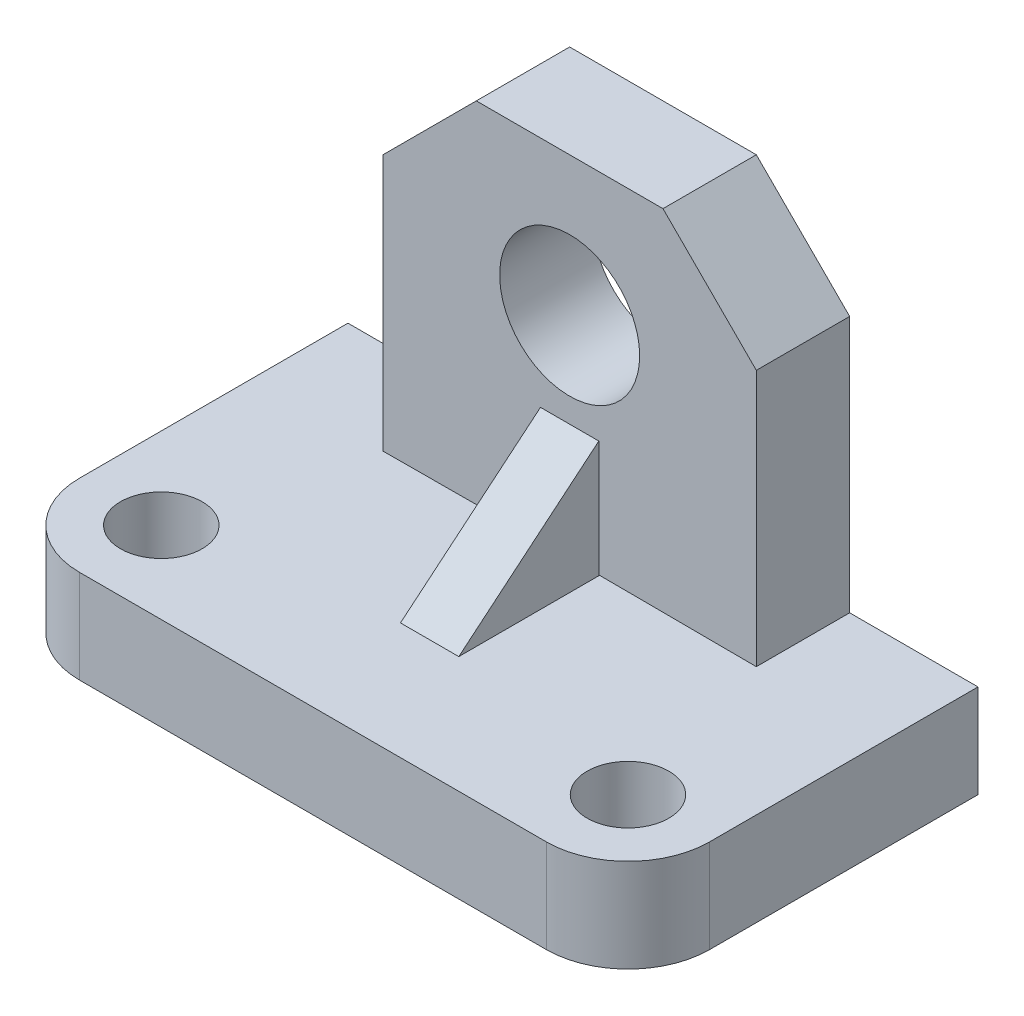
ISO-10303-21;
HEADER;
FILE_DESCRIPTION(('STEP AP214'),'2;1');
FILE_NAME('part.step','',(''),(''),'','','');
FILE_SCHEMA(('AUTOMOTIVE_DESIGN { 1 0 10303 214 1 1 1 1 }'));
ENDSEC;
DATA;
#1=APPLICATION_CONTEXT('core data for automotive mechanical design processes');
#2=APPLICATION_PROTOCOL_DEFINITION('international standard','automotive_design',2000,#1);
#3=PRODUCT_CONTEXT('',#1,'mechanical');
#4=PRODUCT('Part','Part','',(#3));
#5=PRODUCT_RELATED_PRODUCT_CATEGORY('part','',(#4));
#6=PRODUCT_DEFINITION_FORMATION('','',#4);
#7=PRODUCT_DEFINITION_CONTEXT('part definition',#1,'design');
#8=PRODUCT_DEFINITION('design','',#6,#7);
#9=PRODUCT_DEFINITION_SHAPE('','',#8);
#10=(LENGTH_UNIT() NAMED_UNIT(*) SI_UNIT(.MILLI.,.METRE.));
#11=(NAMED_UNIT(*) PLANE_ANGLE_UNIT() SI_UNIT($,.RADIAN.));
#12=(NAMED_UNIT(*) SI_UNIT($,.STERADIAN.) SOLID_ANGLE_UNIT());
#13=UNCERTAINTY_MEASURE_WITH_UNIT(LENGTH_MEASURE(1.E-05),#10,'distance_accuracy_value','');
#14=(GEOMETRIC_REPRESENTATION_CONTEXT(3) GLOBAL_UNCERTAINTY_ASSIGNED_CONTEXT((#13)) GLOBAL_UNIT_ASSIGNED_CONTEXT((#10,
#11,#12)) REPRESENTATION_CONTEXT('',''));
#15=CARTESIAN_POINT('',(0.,0.,0.));
#16=DIRECTION('',(0.,0.,1.));
#17=DIRECTION('',(1.,0.,0.));
#18=AXIS2_PLACEMENT_3D('',#15,#16,#17);
#19=CARTESIAN_POINT('',(2.5,18.,8.));
#20=DIRECTION('',(0.,0.,1.));
#21=DIRECTION('',(1.,0.,0.));
#22=AXIS2_PLACEMENT_3D('',#19,#20,#21);
#23=PLANE('',#22);
#24=DIRECTION('',(0.,1.,0.));
#25=VECTOR('',#24,1.);
#26=CARTESIAN_POINT('',(-2.5,18.,8.));
#27=LINE('',#26,#25);
#28=CARTESIAN_POINT('',(-2.5,8.,8.));
#29=VERTEX_POINT('',#28);
#30=CARTESIAN_POINT('',(-2.5,18.,8.));
#31=VERTEX_POINT('',#30);
#32=EDGE_CURVE('E88',#29,#31,#27,.T.);
#33=ORIENTED_EDGE('',*,*,#32,.T.);
#34=DIRECTION('',(-1.,0.,0.));
#35=VECTOR('',#34,1.);
#36=CARTESIAN_POINT('',(2.5,18.,8.));
#37=LINE('',#36,#35);
#38=CARTESIAN_POINT('',(2.5,18.,8.));
#39=VERTEX_POINT('',#38);
#40=EDGE_CURVE('E12',#39,#31,#37,.T.);
#41=ORIENTED_EDGE('',*,*,#40,.F.);
#42=DIRECTION('',(0.,1.,0.));
#43=VECTOR('',#42,1.);
#44=CARTESIAN_POINT('',(2.5,18.,8.));
#45=LINE('',#44,#43);
#46=CARTESIAN_POINT('',(2.5,8.,8.));
#47=VERTEX_POINT('',#46);
#48=EDGE_CURVE('E81',#47,#39,#45,.T.);
#49=ORIENTED_EDGE('',*,*,#48,.F.);
#50=DIRECTION('',(-1.,0.,0.));
#51=VECTOR('',#50,1.);
#52=CARTESIAN_POINT('',(2.5,8.,8.));
#53=LINE('',#52,#51);
#54=EDGE_CURVE('E89',#47,#29,#53,.T.);
#55=ORIENTED_EDGE('',*,*,#54,.T.);
#56=EDGE_LOOP('',(#33,#41,#49,#55));
#57=FACE_BOUND('',#56,.T.);
#58=ADVANCED_FACE('F41',(#57),#23,.F.);
#59=CARTESIAN_POINT('',(2.5,18.,8.));
#60=DIRECTION('',(0.,-0.768221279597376,-0.64018439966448));
#61=DIRECTION('',(0.,0.64018439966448,-0.768221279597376));
#62=AXIS2_PLACEMENT_3D('',#59,#60,#61);
#63=PLANE('',#62);
#64=DIRECTION('',(0.,-0.64018439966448,0.768221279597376));
#65=VECTOR('',#64,1.);
#66=CARTESIAN_POINT('',(-2.5,18.,8.));
#67=LINE('',#66,#65);
#68=CARTESIAN_POINT('',(-2.5,8.,20.));
#69=VERTEX_POINT('',#68);
#70=EDGE_CURVE('E69',#31,#69,#67,.T.);
#71=ORIENTED_EDGE('',*,*,#70,.T.);
#72=DIRECTION('',(-1.,0.,0.));
#73=VECTOR('',#72,1.);
#74=CARTESIAN_POINT('',(2.5,8.,20.));
#75=LINE('',#74,#73);
#76=CARTESIAN_POINT('',(2.5,8.,20.));
#77=VERTEX_POINT('',#76);
#78=EDGE_CURVE('E49',#77,#69,#75,.T.);
#79=ORIENTED_EDGE('',*,*,#78,.F.);
#80=DIRECTION('',(0.,-0.64018439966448,0.768221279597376));
#81=VECTOR('',#80,1.);
#82=CARTESIAN_POINT('',(2.5,18.,8.));
#83=LINE('',#82,#81);
#84=EDGE_CURVE('E77',#39,#77,#83,.T.);
#85=ORIENTED_EDGE('',*,*,#84,.F.);
#86=ORIENTED_EDGE('',*,*,#40,.T.);
#87=EDGE_LOOP('',(#71,#79,#85,#86));
#88=FACE_BOUND('',#87,.T.);
#89=ADVANCED_FACE('F78',(#88),#63,.F.);
#90=CARTESIAN_POINT('',(2.5,8.,8.));
#91=DIRECTION('',(0.,1.,0.));
#92=DIRECTION('',(0.,0.,1.));
#93=AXIS2_PLACEMENT_3D('',#90,#91,#92);
#94=PLANE('',#93);
#95=DIRECTION('',(0.,0.,-1.));
#96=VECTOR('',#95,1.);
#97=CARTESIAN_POINT('',(-2.5,8.,8.));
#98=LINE('',#97,#96);
#99=EDGE_CURVE('E74',#69,#29,#98,.T.);
#100=ORIENTED_EDGE('',*,*,#99,.T.);
#101=ORIENTED_EDGE('',*,*,#54,.F.);
#102=DIRECTION('',(0.,0.,-1.));
#103=VECTOR('',#102,1.);
#104=CARTESIAN_POINT('',(2.5,8.,8.));
#105=LINE('',#104,#103);
#106=EDGE_CURVE('E57',#77,#47,#105,.T.);
#107=ORIENTED_EDGE('',*,*,#106,.F.);
#108=ORIENTED_EDGE('',*,*,#78,.T.);
#109=EDGE_LOOP('',(#100,#101,#107,#108));
#110=FACE_BOUND('',#109,.T.);
#111=ADVANCED_FACE('F96',(#110),#94,.F.);
#112=CARTESIAN_POINT('',(2.5,8.,8.));
#113=DIRECTION('',(-1.,0.,0.));
#114=DIRECTION('',(0.,0.,1.));
#115=AXIS2_PLACEMENT_3D('',#112,#113,#114);
#116=PLANE('',#115);
#117=ORIENTED_EDGE('',*,*,#48,.T.);
#118=ORIENTED_EDGE('',*,*,#84,.T.);
#119=ORIENTED_EDGE('',*,*,#106,.T.);
#120=EDGE_LOOP('',(#117,#118,#119));
#121=FACE_BOUND('',#120,.T.);
#122=ADVANCED_FACE('F84',(#121),#116,.F.);
#123=CARTESIAN_POINT('',(-2.5,8.,8.));
#124=DIRECTION('',(-1.,0.,0.));
#125=DIRECTION('',(0.,0.,1.));
#126=AXIS2_PLACEMENT_3D('',#123,#124,#125);
#127=PLANE('',#126);
#128=ORIENTED_EDGE('',*,*,#32,.F.);
#129=ORIENTED_EDGE('',*,*,#99,.F.);
#130=ORIENTED_EDGE('',*,*,#70,.F.);
#131=EDGE_LOOP('',(#128,#129,#130));
#132=FACE_BOUND('',#131,.T.);
#133=ADVANCED_FACE('F97',(#132),#127,.T.);
#134=CLOSED_SHELL('',(#58,#89,#111,#122,#133));
#135=MANIFOLD_SOLID_BREP('B2',#134);
#136=CARTESIAN_POINT('',(16.,8.,8.));
#137=DIRECTION('',(0.,0.,1.));
#138=DIRECTION('',(1.,0.,0.));
#139=AXIS2_PLACEMENT_3D('',#136,#137,#138);
#140=PLANE('',#139);
#141=DIRECTION('',(0.999988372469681,-0.00482233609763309,0.));
#142=VECTOR('',#141,1.);
#143=CARTESIAN_POINT('',(0.,8.07715827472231,8.));
#144=LINE('',#143,#142);
#145=CARTESIAN_POINT('',(0.,8.07715827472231,8.));
#146=VERTEX_POINT('',#145);
#147=CARTESIAN_POINT('',(16.,8.,8.));
#148=VERTEX_POINT('',#147);
#149=EDGE_CURVE('E251',#146,#148,#144,.T.);
#150=ORIENTED_EDGE('',*,*,#149,.T.);
#151=DIRECTION('',(0.,1.,0.));
#152=VECTOR('',#151,1.);
#153=CARTESIAN_POINT('',(16.,8.,8.));
#154=LINE('',#153,#152);
#155=CARTESIAN_POINT('',(16.,30.,8.));
#156=VERTEX_POINT('',#155);
#157=EDGE_CURVE('E204',#148,#156,#154,.T.);
#158=ORIENTED_EDGE('',*,*,#157,.T.);
#159=DIRECTION('',(-0.707106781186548,0.707106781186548,0.));
#160=VECTOR('',#159,1.);
#161=CARTESIAN_POINT('',(16.,30.,8.));
#162=LINE('',#161,#160);
#163=CARTESIAN_POINT('',(8.,38.,8.));
#164=VERTEX_POINT('',#163);
#165=EDGE_CURVE('E263',#156,#164,#162,.T.);
#166=ORIENTED_EDGE('',*,*,#165,.T.);
#167=DIRECTION('',(-1.,0.,0.));
#168=VECTOR('',#167,1.);
#169=CARTESIAN_POINT('',(-8.,38.,8.));
#170=LINE('',#169,#168);
#171=CARTESIAN_POINT('',(-8.,38.,8.));
#172=VERTEX_POINT('',#171);
#173=EDGE_CURVE('E220',#164,#172,#170,.T.);
#174=ORIENTED_EDGE('',*,*,#173,.T.);
#175=DIRECTION('',(-0.707106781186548,-0.707106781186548,0.));
#176=VECTOR('',#175,1.);
#177=CARTESIAN_POINT('',(-16.,30.,8.));
#178=LINE('',#177,#176);
#179=CARTESIAN_POINT('',(-16.,30.,8.));
#180=VERTEX_POINT('',#179);
#181=EDGE_CURVE('E214',#172,#180,#178,.T.);
#182=ORIENTED_EDGE('',*,*,#181,.T.);
#183=DIRECTION('',(0.,-1.,0.));
#184=VECTOR('',#183,1.);
#185=CARTESIAN_POINT('',(-16.,8.,8.));
#186=LINE('',#185,#184);
#187=CARTESIAN_POINT('',(-16.,8.,8.));
#188=VERTEX_POINT('',#187);
#189=EDGE_CURVE('E218',#180,#188,#186,.T.);
#190=ORIENTED_EDGE('',*,*,#189,.T.);
#191=DIRECTION('',(0.999988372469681,0.00482233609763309,0.));
#192=VECTOR('',#191,1.);
#193=CARTESIAN_POINT('',(0.,8.07715827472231,8.));
#194=LINE('',#193,#192);
#195=EDGE_CURVE('E164',#188,#146,#194,.T.);
#196=ORIENTED_EDGE('',*,*,#195,.T.);
#197=EDGE_LOOP('',(#150,#158,#166,#174,#182,#190,#196));
#198=FACE_BOUND('',#197,.T.);
#199=CARTESIAN_POINT('',(0.,26.0771582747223,8.));
#200=DIRECTION('',(0.,0.,1.));
#201=DIRECTION('',(1.,0.,0.));
#202=AXIS2_PLACEMENT_3D('',#199,#200,#201);
#203=CIRCLE('',#202,6.);
#204=CARTESIAN_POINT('',(6.,26.0771582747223,8.));
#205=VERTEX_POINT('',#204);
#206=EDGE_CURVE('E242',#205,#205,#203,.T.);
#207=ORIENTED_EDGE('',*,*,#206,.F.);
#208=EDGE_LOOP('',(#207));
#209=FACE_BOUND('',#208,.T.);
#210=ADVANCED_FACE('F147',(#198,#209),#140,.T.);
#211=CARTESIAN_POINT('',(16.,8.,0.));
#212=DIRECTION('',(0.,0.,1.));
#213=DIRECTION('',(1.,0.,0.));
#214=AXIS2_PLACEMENT_3D('',#211,#212,#213);
#215=PLANE('',#214);
#216=DIRECTION('',(0.999988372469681,-0.00482233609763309,0.));
#217=VECTOR('',#216,1.);
#218=CARTESIAN_POINT('',(0.,8.07715827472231,0.));
#219=LINE('',#218,#217);
#220=CARTESIAN_POINT('',(0.,8.07715827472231,0.));
#221=VERTEX_POINT('',#220);
#222=CARTESIAN_POINT('',(16.,8.,0.));
#223=VERTEX_POINT('',#222);
#224=EDGE_CURVE('E238',#221,#223,#219,.T.);
#225=ORIENTED_EDGE('',*,*,#224,.F.);
#226=DIRECTION('',(0.999988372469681,0.00482233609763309,0.));
#227=VECTOR('',#226,1.);
#228=CARTESIAN_POINT('',(0.,8.07715827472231,0.));
#229=LINE('',#228,#227);
#230=CARTESIAN_POINT('',(-16.,8.,0.));
#231=VERTEX_POINT('',#230);
#232=EDGE_CURVE('E196',#231,#221,#229,.T.);
#233=ORIENTED_EDGE('',*,*,#232,.F.);
#234=DIRECTION('',(0.,-1.,0.));
#235=VECTOR('',#234,1.);
#236=CARTESIAN_POINT('',(-16.,8.,0.));
#237=LINE('',#236,#235);
#238=CARTESIAN_POINT('',(-16.,30.,0.));
#239=VERTEX_POINT('',#238);
#240=EDGE_CURVE('E190',#239,#231,#237,.T.);
#241=ORIENTED_EDGE('',*,*,#240,.F.);
#242=DIRECTION('',(-0.707106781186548,-0.707106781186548,0.));
#243=VECTOR('',#242,1.);
#244=CARTESIAN_POINT('',(-16.,30.,0.));
#245=LINE('',#244,#243);
#246=CARTESIAN_POINT('',(-8.,38.,0.));
#247=VERTEX_POINT('',#246);
#248=EDGE_CURVE('E228',#247,#239,#245,.T.);
#249=ORIENTED_EDGE('',*,*,#248,.F.);
#250=DIRECTION('',(-1.,0.,0.));
#251=VECTOR('',#250,1.);
#252=CARTESIAN_POINT('',(-8.,38.,0.));
#253=LINE('',#252,#251);
#254=CARTESIAN_POINT('',(8.,38.,0.));
#255=VERTEX_POINT('',#254);
#256=EDGE_CURVE('E246',#255,#247,#253,.T.);
#257=ORIENTED_EDGE('',*,*,#256,.F.);
#258=DIRECTION('',(-0.707106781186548,0.707106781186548,0.));
#259=VECTOR('',#258,1.);
#260=CARTESIAN_POINT('',(16.,30.,0.));
#261=LINE('',#260,#259);
#262=CARTESIAN_POINT('',(16.,30.,0.));
#263=VERTEX_POINT('',#262);
#264=EDGE_CURVE('E244',#263,#255,#261,.T.);
#265=ORIENTED_EDGE('',*,*,#264,.F.);
#266=DIRECTION('',(0.,1.,0.));
#267=VECTOR('',#266,1.);
#268=CARTESIAN_POINT('',(16.,8.,0.));
#269=LINE('',#268,#267);
#270=EDGE_CURVE('E241',#223,#263,#269,.T.);
#271=ORIENTED_EDGE('',*,*,#270,.F.);
#272=EDGE_LOOP('',(#225,#233,#241,#249,#257,#265,#271));
#273=FACE_BOUND('',#272,.T.);
#274=CARTESIAN_POINT('',(0.,26.0771582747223,0.));
#275=DIRECTION('',(0.,0.,1.));
#276=DIRECTION('',(1.,0.,0.));
#277=AXIS2_PLACEMENT_3D('',#274,#275,#276);
#278=CIRCLE('',#277,6.);
#279=CARTESIAN_POINT('',(6.,26.0771582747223,0.));
#280=VERTEX_POINT('',#279);
#281=EDGE_CURVE('E275',#280,#280,#278,.T.);
#282=ORIENTED_EDGE('',*,*,#281,.T.);
#283=EDGE_LOOP('',(#282));
#284=FACE_BOUND('',#283,.T.);
#285=ADVANCED_FACE('F267',(#273,#284),#215,.F.);
#286=CARTESIAN_POINT('',(0.,8.07715827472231,8.));
#287=DIRECTION('',(0.00482233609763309,0.999988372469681,0.));
#288=DIRECTION('',(-0.999988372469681,0.00482233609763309,0.));
#289=AXIS2_PLACEMENT_3D('',#286,#287,#288);
#290=PLANE('',#289);
#291=ORIENTED_EDGE('',*,*,#224,.T.);
#292=DIRECTION('',(0.,0.,-1.));
#293=VECTOR('',#292,1.);
#294=CARTESIAN_POINT('',(16.,8.,8.));
#295=LINE('',#294,#293);
#296=EDGE_CURVE('E39',#148,#223,#295,.T.);
#297=ORIENTED_EDGE('',*,*,#296,.F.);
#298=ORIENTED_EDGE('',*,*,#149,.F.);
#299=DIRECTION('',(0.,0.,-1.));
#300=VECTOR('',#299,1.);
#301=CARTESIAN_POINT('',(0.,8.07715827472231,8.));
#302=LINE('',#301,#300);
#303=EDGE_CURVE('E234',#146,#221,#302,.T.);
#304=ORIENTED_EDGE('',*,*,#303,.T.);
#305=EDGE_LOOP('',(#291,#297,#298,#304));
#306=FACE_BOUND('',#305,.T.);
#307=ADVANCED_FACE('F149',(#306),#290,.F.);
#308=CARTESIAN_POINT('',(16.,8.,8.));
#309=DIRECTION('',(-1.,0.,0.));
#310=DIRECTION('',(0.,0.,1.));
#311=AXIS2_PLACEMENT_3D('',#308,#309,#310);
#312=PLANE('',#311);
#313=ORIENTED_EDGE('',*,*,#270,.T.);
#314=DIRECTION('',(0.,0.,-1.));
#315=VECTOR('',#314,1.);
#316=CARTESIAN_POINT('',(16.,30.,8.));
#317=LINE('',#316,#315);
#318=EDGE_CURVE('E156',#156,#263,#317,.T.);
#319=ORIENTED_EDGE('',*,*,#318,.F.);
#320=ORIENTED_EDGE('',*,*,#157,.F.);
#321=ORIENTED_EDGE('',*,*,#296,.T.);
#322=EDGE_LOOP('',(#313,#319,#320,#321));
#323=FACE_BOUND('',#322,.T.);
#324=ADVANCED_FACE('F301',(#323),#312,.F.);
#325=CARTESIAN_POINT('',(16.,30.,8.));
#326=DIRECTION('',(-0.707106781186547,-0.707106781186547,0.));
#327=DIRECTION('',(0.707106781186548,-0.707106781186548,0.));
#328=AXIS2_PLACEMENT_3D('',#325,#326,#327);
#329=PLANE('',#328);
#330=ORIENTED_EDGE('',*,*,#264,.T.);
#331=DIRECTION('',(0.,0.,-1.));
#332=VECTOR('',#331,1.);
#333=CARTESIAN_POINT('',(8.,38.,8.));
#334=LINE('',#333,#332);
#335=EDGE_CURVE('E255',#164,#255,#334,.T.);
#336=ORIENTED_EDGE('',*,*,#335,.F.);
#337=ORIENTED_EDGE('',*,*,#165,.F.);
#338=ORIENTED_EDGE('',*,*,#318,.T.);
#339=EDGE_LOOP('',(#330,#336,#337,#338));
#340=FACE_BOUND('',#339,.T.);
#341=ADVANCED_FACE('F261',(#340),#329,.F.);
#342=CARTESIAN_POINT('',(-8.,38.,8.));
#343=DIRECTION('',(0.,-1.,0.));
#344=DIRECTION('',(0.,0.,-1.));
#345=AXIS2_PLACEMENT_3D('',#342,#343,#344);
#346=PLANE('',#345);
#347=ORIENTED_EDGE('',*,*,#256,.T.);
#348=DIRECTION('',(0.,0.,-1.));
#349=VECTOR('',#348,1.);
#350=CARTESIAN_POINT('',(-8.,38.,8.));
#351=LINE('',#350,#349);
#352=EDGE_CURVE('E229',#172,#247,#351,.T.);
#353=ORIENTED_EDGE('',*,*,#352,.F.);
#354=ORIENTED_EDGE('',*,*,#173,.F.);
#355=ORIENTED_EDGE('',*,*,#335,.T.);
#356=EDGE_LOOP('',(#347,#353,#354,#355));
#357=FACE_BOUND('',#356,.T.);
#358=ADVANCED_FACE('F270',(#357),#346,.F.);
#359=CARTESIAN_POINT('',(-16.,30.,8.));
#360=DIRECTION('',(0.707106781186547,-0.707106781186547,0.));
#361=DIRECTION('',(0.707106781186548,0.707106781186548,0.));
#362=AXIS2_PLACEMENT_3D('',#359,#360,#361);
#363=PLANE('',#362);
#364=ORIENTED_EDGE('',*,*,#248,.T.);
#365=DIRECTION('',(0.,0.,-1.));
#366=VECTOR('',#365,1.);
#367=CARTESIAN_POINT('',(-16.,30.,8.));
#368=LINE('',#367,#366);
#369=EDGE_CURVE('E225',#180,#239,#368,.T.);
#370=ORIENTED_EDGE('',*,*,#369,.F.);
#371=ORIENTED_EDGE('',*,*,#181,.F.);
#372=ORIENTED_EDGE('',*,*,#352,.T.);
#373=EDGE_LOOP('',(#364,#370,#371,#372));
#374=FACE_BOUND('',#373,.T.);
#375=ADVANCED_FACE('F226',(#374),#363,.F.);
#376=CARTESIAN_POINT('',(-16.,8.,8.));
#377=DIRECTION('',(1.,0.,0.));
#378=DIRECTION('',(0.,0.,-1.));
#379=AXIS2_PLACEMENT_3D('',#376,#377,#378);
#380=PLANE('',#379);
#381=ORIENTED_EDGE('',*,*,#240,.T.);
#382=DIRECTION('',(0.,0.,-1.));
#383=VECTOR('',#382,1.);
#384=CARTESIAN_POINT('',(-16.,8.,8.));
#385=LINE('',#384,#383);
#386=EDGE_CURVE('E230',#188,#231,#385,.T.);
#387=ORIENTED_EDGE('',*,*,#386,.F.);
#388=ORIENTED_EDGE('',*,*,#189,.F.);
#389=ORIENTED_EDGE('',*,*,#369,.T.);
#390=EDGE_LOOP('',(#381,#387,#388,#389));
#391=FACE_BOUND('',#390,.T.);
#392=ADVANCED_FACE('F232',(#391),#380,.F.);
#393=CARTESIAN_POINT('',(0.,8.07715827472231,8.));
#394=DIRECTION('',(-0.00482233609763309,0.999988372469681,0.));
#395=DIRECTION('',(-0.999988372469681,-0.00482233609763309,0.));
#396=AXIS2_PLACEMENT_3D('',#393,#394,#395);
#397=PLANE('',#396);
#398=ORIENTED_EDGE('',*,*,#232,.T.);
#399=ORIENTED_EDGE('',*,*,#303,.F.);
#400=ORIENTED_EDGE('',*,*,#195,.F.);
#401=ORIENTED_EDGE('',*,*,#386,.T.);
#402=EDGE_LOOP('',(#398,#399,#400,#401));
#403=FACE_BOUND('',#402,.T.);
#404=ADVANCED_FACE('F291',(#403),#397,.F.);
#405=CARTESIAN_POINT('',(0.,26.0771582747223,8.));
#406=DIRECTION('',(0.,0.,-1.));
#407=DIRECTION('',(-1.,0.,0.));
#408=AXIS2_PLACEMENT_3D('',#405,#406,#407);
#409=CYLINDRICAL_SURFACE('',#408,6.);
#410=ORIENTED_EDGE('',*,*,#206,.T.);
#411=EDGE_LOOP('',(#410));
#412=FACE_BOUND('',#411,.T.);
#413=ORIENTED_EDGE('',*,*,#281,.F.);
#414=EDGE_LOOP('',(#413));
#415=FACE_BOUND('',#414,.T.);
#416=ADVANCED_FACE('F281',(#412,#415),#409,.F.);
#417=CLOSED_SHELL('',(#210,#285,#307,#324,#341,#358,#375,#392,#404,#416));
#418=MANIFOLD_SOLID_BREP('B6',#417);
#419=CARTESIAN_POINT('',(-20.,8.,23.));
#420=DIRECTION('',(0.,-1.,0.));
#421=DIRECTION('',(0.,0.,-1.));
#422=AXIS2_PLACEMENT_3D('',#419,#420,#421);
#423=PLANE('',#422);
#424=CARTESIAN_POINT('',(-20.,8.,23.));
#425=DIRECTION('',(0.,1.,0.));
#426=DIRECTION('',(0.,0.,1.));
#427=AXIS2_PLACEMENT_3D('',#424,#425,#426);
#428=CIRCLE('',#427,3.5);
#429=CARTESIAN_POINT('',(-20.,8.,26.5));
#430=VERTEX_POINT('',#429);
#431=EDGE_CURVE('E458',#430,#430,#428,.T.);
#432=ORIENTED_EDGE('',*,*,#431,.F.);
#433=EDGE_LOOP('',(#432));
#434=FACE_BOUND('',#433,.T.);
#435=DIRECTION('',(0.,0.,1.));
#436=VECTOR('',#435,1.);
#437=CARTESIAN_POINT('',(-27.,8.,0.));
#438=LINE('',#437,#436);
#439=CARTESIAN_POINT('',(-27.,8.,0.));
#440=VERTEX_POINT('',#439);
#441=CARTESIAN_POINT('',(-27.,8.,23.));
#442=VERTEX_POINT('',#441);
#443=EDGE_CURVE('E465',#440,#442,#438,.T.);
#444=ORIENTED_EDGE('',*,*,#443,.T.);
#445=CARTESIAN_POINT('',(-20.,8.,23.));
#446=DIRECTION('',(0.,1.,0.));
#447=DIRECTION('',(0.,0.,-1.));
#448=AXIS2_PLACEMENT_3D('',#445,#446,#447);
#449=CIRCLE('',#448,7.);
#450=CARTESIAN_POINT('',(-19.9999999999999,8.,30.));
#451=VERTEX_POINT('',#450);
#452=EDGE_CURVE('E423',#442,#451,#449,.T.);
#453=ORIENTED_EDGE('',*,*,#452,.T.);
#454=DIRECTION('',(1.,0.,0.));
#455=VECTOR('',#454,1.);
#456=CARTESIAN_POINT('',(-19.9999999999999,8.,30.));
#457=LINE('',#456,#455);
#458=CARTESIAN_POINT('',(19.9999999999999,8.,30.));
#459=VERTEX_POINT('',#458);
#460=EDGE_CURVE('E436',#451,#459,#457,.T.);
#461=ORIENTED_EDGE('',*,*,#460,.T.);
#462=CARTESIAN_POINT('',(20.,8.,23.));
#463=DIRECTION('',(0.,1.,0.));
#464=DIRECTION('',(0.,0.,1.));
#465=AXIS2_PLACEMENT_3D('',#462,#463,#464);
#466=CIRCLE('',#465,7.);
#467=CARTESIAN_POINT('',(27.,8.,23.));
#468=VERTEX_POINT('',#467);
#469=EDGE_CURVE('E430',#459,#468,#466,.T.);
#470=ORIENTED_EDGE('',*,*,#469,.T.);
#471=DIRECTION('',(0.,0.,-1.));
#472=VECTOR('',#471,1.);
#473=CARTESIAN_POINT('',(27.,8.,0.));
#474=LINE('',#473,#472);
#475=CARTESIAN_POINT('',(27.,8.,0.));
#476=VERTEX_POINT('',#475);
#477=EDGE_CURVE('E434',#468,#476,#474,.T.);
#478=ORIENTED_EDGE('',*,*,#477,.T.);
#479=DIRECTION('',(-1.,0.,0.));
#480=VECTOR('',#479,1.);
#481=CARTESIAN_POINT('',(27.,8.,0.));
#482=LINE('',#481,#480);
#483=EDGE_CURVE('E386',#476,#440,#482,.T.);
#484=ORIENTED_EDGE('',*,*,#483,.T.);
#485=EDGE_LOOP('',(#444,#453,#461,#470,#478,#484));
#486=FACE_BOUND('',#485,.T.);
#487=CARTESIAN_POINT('',(20.,8.,23.));
#488=DIRECTION('',(0.,1.,0.));
#489=DIRECTION('',(0.,0.,-1.));
#490=AXIS2_PLACEMENT_3D('',#487,#488,#489);
#491=CIRCLE('',#490,3.5);
#492=CARTESIAN_POINT('',(20.,8.,19.5));
#493=VERTEX_POINT('',#492);
#494=EDGE_CURVE('E508',#493,#493,#491,.T.);
#495=ORIENTED_EDGE('',*,*,#494,.F.);
#496=EDGE_LOOP('',(#495));
#497=FACE_BOUND('',#496,.T.);
#498=ADVANCED_FACE('F369',(#434,#486,#497),#423,.F.);
#499=CARTESIAN_POINT('',(-20.,0.,23.));
#500=DIRECTION('',(0.,-1.,0.));
#501=DIRECTION('',(0.,0.,-1.));
#502=AXIS2_PLACEMENT_3D('',#499,#500,#501);
#503=PLANE('',#502);
#504=CARTESIAN_POINT('',(-20.,0.,23.));
#505=DIRECTION('',(0.,1.,0.));
#506=DIRECTION('',(0.,0.,1.));
#507=AXIS2_PLACEMENT_3D('',#504,#505,#506);
#508=CIRCLE('',#507,3.5);
#509=CARTESIAN_POINT('',(-20.,0.,26.5));
#510=VERTEX_POINT('',#509);
#511=EDGE_CURVE('E513',#510,#510,#508,.T.);
#512=ORIENTED_EDGE('',*,*,#511,.T.);
#513=EDGE_LOOP('',(#512));
#514=FACE_BOUND('',#513,.T.);
#515=DIRECTION('',(0.,0.,1.));
#516=VECTOR('',#515,1.);
#517=CARTESIAN_POINT('',(-27.,0.,0.));
#518=LINE('',#517,#516);
#519=CARTESIAN_POINT('',(-27.,0.,0.));
#520=VERTEX_POINT('',#519);
#521=CARTESIAN_POINT('',(-27.,0.,23.));
#522=VERTEX_POINT('',#521);
#523=EDGE_CURVE('E454',#520,#522,#518,.T.);
#524=ORIENTED_EDGE('',*,*,#523,.F.);
#525=DIRECTION('',(-1.,0.,0.));
#526=VECTOR('',#525,1.);
#527=CARTESIAN_POINT('',(27.,0.,0.));
#528=LINE('',#527,#526);
#529=CARTESIAN_POINT('',(27.,0.,0.));
#530=VERTEX_POINT('',#529);
#531=EDGE_CURVE('E415',#530,#520,#528,.T.);
#532=ORIENTED_EDGE('',*,*,#531,.F.);
#533=DIRECTION('',(0.,0.,-1.));
#534=VECTOR('',#533,1.);
#535=CARTESIAN_POINT('',(27.,0.,0.));
#536=LINE('',#535,#534);
#537=CARTESIAN_POINT('',(27.,0.,23.));
#538=VERTEX_POINT('',#537);
#539=EDGE_CURVE('E409',#538,#530,#536,.T.);
#540=ORIENTED_EDGE('',*,*,#539,.F.);
#541=CARTESIAN_POINT('',(20.,0.,23.));
#542=DIRECTION('',(0.,1.,0.));
#543=DIRECTION('',(0.,0.,1.));
#544=AXIS2_PLACEMENT_3D('',#541,#542,#543);
#545=CIRCLE('',#544,7.);
#546=CARTESIAN_POINT('',(19.9999999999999,0.,30.));
#547=VERTEX_POINT('',#546);
#548=EDGE_CURVE('E444',#547,#538,#545,.T.);
#549=ORIENTED_EDGE('',*,*,#548,.F.);
#550=DIRECTION('',(1.,0.,0.));
#551=VECTOR('',#550,1.);
#552=CARTESIAN_POINT('',(-19.9999999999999,0.,30.));
#553=LINE('',#552,#551);
#554=CARTESIAN_POINT('',(-19.9999999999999,0.,30.));
#555=VERTEX_POINT('',#554);
#556=EDGE_CURVE('E460',#555,#547,#553,.T.);
#557=ORIENTED_EDGE('',*,*,#556,.F.);
#558=CARTESIAN_POINT('',(-20.,0.,23.));
#559=DIRECTION('',(0.,1.,0.));
#560=DIRECTION('',(0.,0.,-1.));
#561=AXIS2_PLACEMENT_3D('',#558,#559,#560);
#562=CIRCLE('',#561,7.);
#563=EDGE_CURVE('E457',#522,#555,#562,.T.);
#564=ORIENTED_EDGE('',*,*,#563,.F.);
#565=EDGE_LOOP('',(#524,#532,#540,#549,#557,#564));
#566=FACE_BOUND('',#565,.T.);
#567=CARTESIAN_POINT('',(20.,0.,23.));
#568=DIRECTION('',(0.,1.,0.));
#569=DIRECTION('',(0.,0.,-1.));
#570=AXIS2_PLACEMENT_3D('',#567,#568,#569);
#571=CIRCLE('',#570,3.5);
#572=CARTESIAN_POINT('',(20.,0.,19.5));
#573=VERTEX_POINT('',#572);
#574=EDGE_CURVE('E511',#573,#573,#571,.T.);
#575=ORIENTED_EDGE('',*,*,#574,.T.);
#576=EDGE_LOOP('',(#575));
#577=FACE_BOUND('',#576,.T.);
#578=ADVANCED_FACE('F474',(#514,#566,#577),#503,.T.);
#579=CARTESIAN_POINT('',(-27.,8.,0.));
#580=DIRECTION('',(1.,0.,0.));
#581=DIRECTION('',(0.,0.,-1.));
#582=AXIS2_PLACEMENT_3D('',#579,#580,#581);
#583=PLANE('',#582);
#584=ORIENTED_EDGE('',*,*,#523,.T.);
#585=DIRECTION('',(0.,-1.,0.));
#586=VECTOR('',#585,1.);
#587=CARTESIAN_POINT('',(-27.,8.,23.));
#588=LINE('',#587,#586);
#589=EDGE_CURVE('E145',#442,#522,#588,.T.);
#590=ORIENTED_EDGE('',*,*,#589,.F.);
#591=ORIENTED_EDGE('',*,*,#443,.F.);
#592=DIRECTION('',(0.,-1.,0.));
#593=VECTOR('',#592,1.);
#594=CARTESIAN_POINT('',(-27.,8.,0.));
#595=LINE('',#594,#593);
#596=EDGE_CURVE('E450',#440,#520,#595,.T.);
#597=ORIENTED_EDGE('',*,*,#596,.T.);
#598=EDGE_LOOP('',(#584,#590,#591,#597));
#599=FACE_BOUND('',#598,.T.);
#600=ADVANCED_FACE('F371',(#599),#583,.F.);
#601=CARTESIAN_POINT('',(-20.,8.,23.));
#602=DIRECTION('',(0.,-1.,0.));
#603=DIRECTION('',(0.,0.,-1.));
#604=AXIS2_PLACEMENT_3D('',#601,#602,#603);
#605=CYLINDRICAL_SURFACE('',#604,7.);
#606=ORIENTED_EDGE('',*,*,#563,.T.);
#607=DIRECTION('',(0.,-1.,0.));
#608=VECTOR('',#607,1.);
#609=CARTESIAN_POINT('',(-19.9999999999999,8.,30.));
#610=LINE('',#609,#608);
#611=EDGE_CURVE('E378',#451,#555,#610,.T.);
#612=ORIENTED_EDGE('',*,*,#611,.F.);
#613=ORIENTED_EDGE('',*,*,#452,.F.);
#614=ORIENTED_EDGE('',*,*,#589,.T.);
#615=EDGE_LOOP('',(#606,#612,#613,#614));
#616=FACE_BOUND('',#615,.T.);
#617=ADVANCED_FACE('F554',(#616),#605,.T.);
#618=CARTESIAN_POINT('',(-19.9999999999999,8.,30.));
#619=DIRECTION('',(0.,0.,-1.));
#620=DIRECTION('',(-1.,0.,0.));
#621=AXIS2_PLACEMENT_3D('',#618,#619,#620);
#622=PLANE('',#621);
#623=ORIENTED_EDGE('',*,*,#556,.T.);
#624=DIRECTION('',(0.,-1.,0.));
#625=VECTOR('',#624,1.);
#626=CARTESIAN_POINT('',(19.9999999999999,8.,30.));
#627=LINE('',#626,#625);
#628=EDGE_CURVE('E445',#459,#547,#627,.T.);
#629=ORIENTED_EDGE('',*,*,#628,.F.);
#630=ORIENTED_EDGE('',*,*,#460,.F.);
#631=ORIENTED_EDGE('',*,*,#611,.T.);
#632=EDGE_LOOP('',(#623,#629,#630,#631));
#633=FACE_BOUND('',#632,.T.);
#634=ADVANCED_FACE('F471',(#633),#622,.F.);
#635=CARTESIAN_POINT('',(20.,8.,23.));
#636=DIRECTION('',(0.,-1.,0.));
#637=DIRECTION('',(0.,0.,-1.));
#638=AXIS2_PLACEMENT_3D('',#635,#636,#637);
#639=CYLINDRICAL_SURFACE('',#638,7.);
#640=ORIENTED_EDGE('',*,*,#548,.T.);
#641=DIRECTION('',(0.,-1.,0.));
#642=VECTOR('',#641,1.);
#643=CARTESIAN_POINT('',(27.,8.,23.));
#644=LINE('',#643,#642);
#645=EDGE_CURVE('E441',#468,#538,#644,.T.);
#646=ORIENTED_EDGE('',*,*,#645,.F.);
#647=ORIENTED_EDGE('',*,*,#469,.F.);
#648=ORIENTED_EDGE('',*,*,#628,.T.);
#649=EDGE_LOOP('',(#640,#646,#647,#648));
#650=FACE_BOUND('',#649,.T.);
#651=ADVANCED_FACE('F442',(#650),#639,.T.);
#652=CARTESIAN_POINT('',(27.,8.,0.));
#653=DIRECTION('',(-1.,0.,0.));
#654=DIRECTION('',(0.,0.,1.));
#655=AXIS2_PLACEMENT_3D('',#652,#653,#654);
#656=PLANE('',#655);
#657=ORIENTED_EDGE('',*,*,#539,.T.);
#658=DIRECTION('',(0.,-1.,0.));
#659=VECTOR('',#658,1.);
#660=CARTESIAN_POINT('',(27.,8.,0.));
#661=LINE('',#660,#659);
#662=EDGE_CURVE('E446',#476,#530,#661,.T.);
#663=ORIENTED_EDGE('',*,*,#662,.F.);
#664=ORIENTED_EDGE('',*,*,#477,.F.);
#665=ORIENTED_EDGE('',*,*,#645,.T.);
#666=EDGE_LOOP('',(#657,#663,#664,#665));
#667=FACE_BOUND('',#666,.T.);
#668=ADVANCED_FACE('F448',(#667),#656,.F.);
#669=CARTESIAN_POINT('',(27.,8.,0.));
#670=DIRECTION('',(0.,0.,1.));
#671=DIRECTION('',(1.,0.,0.));
#672=AXIS2_PLACEMENT_3D('',#669,#670,#671);
#673=PLANE('',#672);
#674=ORIENTED_EDGE('',*,*,#531,.T.);
#675=ORIENTED_EDGE('',*,*,#596,.F.);
#676=ORIENTED_EDGE('',*,*,#483,.F.);
#677=ORIENTED_EDGE('',*,*,#662,.T.);
#678=EDGE_LOOP('',(#674,#675,#676,#677));
#679=FACE_BOUND('',#678,.T.);
#680=ADVANCED_FACE('F479',(#679),#673,.F.);
#681=CARTESIAN_POINT('',(-20.,8.,23.));
#682=DIRECTION('',(0.,-1.,0.));
#683=DIRECTION('',(0.,0.,-1.));
#684=AXIS2_PLACEMENT_3D('',#681,#682,#683);
#685=CYLINDRICAL_SURFACE('',#684,3.5);
#686=ORIENTED_EDGE('',*,*,#431,.T.);
#687=EDGE_LOOP('',(#686));
#688=FACE_BOUND('',#687,.T.);
#689=ORIENTED_EDGE('',*,*,#511,.F.);
#690=EDGE_LOOP('',(#689));
#691=FACE_BOUND('',#690,.T.);
#692=ADVANCED_FACE('F481',(#688,#691),#685,.F.);
#693=CARTESIAN_POINT('',(20.,8.,23.));
#694=DIRECTION('',(0.,-1.,0.));
#695=DIRECTION('',(0.,0.,-1.));
#696=AXIS2_PLACEMENT_3D('',#693,#694,#695);
#697=CYLINDRICAL_SURFACE('',#696,3.5);
#698=ORIENTED_EDGE('',*,*,#494,.T.);
#699=EDGE_LOOP('',(#698));
#700=FACE_BOUND('',#699,.T.);
#701=ORIENTED_EDGE('',*,*,#574,.F.);
#702=EDGE_LOOP('',(#701));
#703=FACE_BOUND('',#702,.T.);
#704=ADVANCED_FACE('F487',(#700,#703),#697,.F.);
#705=CLOSED_SHELL('',(#498,#578,#600,#617,#634,#651,#668,#680,#692,#704));
#706=MANIFOLD_SOLID_BREP('B33',#705);
#707=ADVANCED_BREP_SHAPE_REPRESENTATION('',(#18,#135,#418,#706),#14);
#708=SHAPE_DEFINITION_REPRESENTATION(#9,#707);
ENDSEC;
END-ISO-10303-21;
